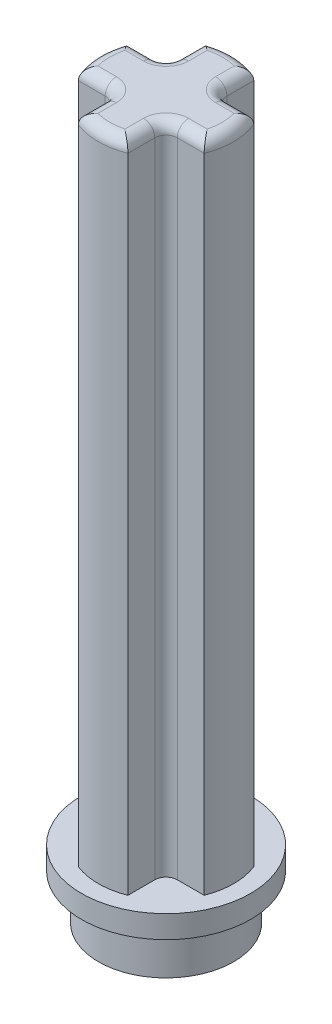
ISO-10303-21;
HEADER;
FILE_DESCRIPTION(('STEP AP214'),'2;1');
FILE_NAME('part.step','',(''),(''),'','','');
FILE_SCHEMA(('AUTOMOTIVE_DESIGN { 1 0 10303 214 1 1 1 1 }'));
ENDSEC;
DATA;
#1=APPLICATION_CONTEXT('core data for automotive mechanical design processes');
#2=APPLICATION_PROTOCOL_DEFINITION('international standard','automotive_design',2000,#1);
#3=PRODUCT_CONTEXT('',#1,'mechanical');
#4=PRODUCT('Part','Part','',(#3));
#5=PRODUCT_RELATED_PRODUCT_CATEGORY('part','',(#4));
#6=PRODUCT_DEFINITION_FORMATION('','',#4);
#7=PRODUCT_DEFINITION_CONTEXT('part definition',#1,'design');
#8=PRODUCT_DEFINITION('design','',#6,#7);
#9=PRODUCT_DEFINITION_SHAPE('','',#8);
#10=(LENGTH_UNIT() NAMED_UNIT(*) SI_UNIT(.MILLI.,.METRE.));
#11=(NAMED_UNIT(*) PLANE_ANGLE_UNIT() SI_UNIT($,.RADIAN.));
#12=(NAMED_UNIT(*) SI_UNIT($,.STERADIAN.) SOLID_ANGLE_UNIT());
#13=UNCERTAINTY_MEASURE_WITH_UNIT(LENGTH_MEASURE(1.E-05),#10,'distance_accuracy_value','');
#14=(GEOMETRIC_REPRESENTATION_CONTEXT(3) GLOBAL_UNCERTAINTY_ASSIGNED_CONTEXT((#13)) GLOBAL_UNIT_ASSIGNED_CONTEXT((#10,
#11,#12)) REPRESENTATION_CONTEXT('',''));
#15=CARTESIAN_POINT('',(0.,0.,0.));
#16=DIRECTION('',(0.,0.,1.));
#17=DIRECTION('',(1.,0.,0.));
#18=AXIS2_PLACEMENT_3D('',#15,#16,#17);
#19=CARTESIAN_POINT('',(-0.88,23.2,-2.23284571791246));
#20=DIRECTION('',(1.,0.,0.));
#21=DIRECTION('',(0.,0.,-1.));
#22=AXIS2_PLACEMENT_3D('',#19,#20,#21);
#23=PLANE('',#22);
#24=DIRECTION('',(0.,-1.,0.));
#25=VECTOR('',#24,1.);
#26=CARTESIAN_POINT('',(-0.88,23.2,-1.28));
#27=LINE('',#26,#25);
#28=CARTESIAN_POINT('',(-0.88,0.,-1.28));
#29=VERTEX_POINT('',#28);
#30=CARTESIAN_POINT('',(-0.88,22.8,-1.28));
#31=VERTEX_POINT('',#30);
#32=EDGE_CURVE('E55',#29,#31,#27,.F.);
#33=ORIENTED_EDGE('',*,*,#32,.T.);
#34=DIRECTION('',(0.,0.,1.));
#35=VECTOR('',#34,1.);
#36=CARTESIAN_POINT('',(-0.88,22.8,-2.23284571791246));
#37=LINE('',#36,#35);
#38=CARTESIAN_POINT('',(-0.88,22.8,-2.23284571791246));
#39=VERTEX_POINT('',#38);
#40=EDGE_CURVE('E208',#31,#39,#37,.F.);
#41=ORIENTED_EDGE('',*,*,#40,.T.);
#42=DIRECTION('',(0.,-1.,0.));
#43=VECTOR('',#42,1.);
#44=CARTESIAN_POINT('',(-0.88,23.2,-2.23284571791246));
#45=LINE('',#44,#43);
#46=CARTESIAN_POINT('',(-0.88,0.,-2.23284571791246));
#47=VERTEX_POINT('',#46);
#48=EDGE_CURVE('E213',#39,#47,#45,.T.);
#49=ORIENTED_EDGE('',*,*,#48,.T.);
#50=DIRECTION('',(0.,0.,1.));
#51=VECTOR('',#50,1.);
#52=CARTESIAN_POINT('',(-0.88,0.,-2.23284571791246));
#53=LINE('',#52,#51);
#54=EDGE_CURVE('E211',#47,#29,#53,.T.);
#55=ORIENTED_EDGE('',*,*,#54,.T.);
#56=EDGE_LOOP('',(#33,#41,#49,#55));
#57=FACE_BOUND('',#56,.T.);
#58=ADVANCED_FACE('F39',(#57),#23,.F.);
#59=CARTESIAN_POINT('',(-2.23284571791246,23.2,-0.88));
#60=DIRECTION('',(0.,0.,1.));
#61=DIRECTION('',(1.,0.,0.));
#62=AXIS2_PLACEMENT_3D('',#59,#60,#61);
#63=PLANE('',#62);
#64=DIRECTION('',(0.,-1.,0.));
#65=VECTOR('',#64,1.);
#66=CARTESIAN_POINT('',(-2.23284571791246,23.2,-0.88));
#67=LINE('',#66,#65);
#68=CARTESIAN_POINT('',(-2.23284571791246,22.8,-0.88));
#69=VERTEX_POINT('',#68);
#70=CARTESIAN_POINT('',(-2.23284571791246,0.,-0.88));
#71=VERTEX_POINT('',#70);
#72=EDGE_CURVE('E554',#69,#71,#67,.T.);
#73=ORIENTED_EDGE('',*,*,#72,.F.);
#74=DIRECTION('',(-1.,0.,0.));
#75=VECTOR('',#74,1.);
#76=CARTESIAN_POINT('',(-0.88,22.8,-0.88));
#77=LINE('',#76,#75);
#78=CARTESIAN_POINT('',(-1.28,22.8,-0.88));
#79=VERTEX_POINT('',#78);
#80=EDGE_CURVE('E63',#69,#79,#77,.F.);
#81=ORIENTED_EDGE('',*,*,#80,.T.);
#82=DIRECTION('',(0.,-1.,0.));
#83=VECTOR('',#82,1.);
#84=CARTESIAN_POINT('',(-1.28,0.,-0.88));
#85=LINE('',#84,#83);
#86=CARTESIAN_POINT('',(-1.28,0.,-0.88));
#87=VERTEX_POINT('',#86);
#88=EDGE_CURVE('E660',#79,#87,#85,.T.);
#89=ORIENTED_EDGE('',*,*,#88,.T.);
#90=DIRECTION('',(-1.,0.,0.));
#91=VECTOR('',#90,1.);
#92=CARTESIAN_POINT('',(-2.23284571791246,0.,-0.88));
#93=LINE('',#92,#91);
#94=EDGE_CURVE('E218',#87,#71,#93,.T.);
#95=ORIENTED_EDGE('',*,*,#94,.T.);
#96=EDGE_LOOP('',(#73,#81,#89,#95));
#97=FACE_BOUND('',#96,.T.);
#98=ADVANCED_FACE('F397',(#97),#63,.F.);
#99=CARTESIAN_POINT('',(0.,23.2,0.));
#100=DIRECTION('',(0.,-1.,0.));
#101=DIRECTION('',(0.,0.,-1.));
#102=AXIS2_PLACEMENT_3D('',#99,#100,#101);
#103=CYLINDRICAL_SURFACE('',#102,2.4);
#104=DIRECTION('',(0.,-1.,0.));
#105=VECTOR('',#104,1.);
#106=CARTESIAN_POINT('',(-2.23284571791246,23.2,0.880000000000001));
#107=LINE('',#106,#105);
#108=CARTESIAN_POINT('',(-2.23284571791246,22.8,0.880000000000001));
#109=VERTEX_POINT('',#108);
#110=CARTESIAN_POINT('',(-2.23284571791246,0.,0.880000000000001));
#111=VERTEX_POINT('',#110);
#112=EDGE_CURVE('E551',#109,#111,#107,.T.);
#113=ORIENTED_EDGE('',*,*,#112,.F.);
#114=CARTESIAN_POINT('',(0.,22.8,0.));
#115=DIRECTION('',(0.,1.,0.));
#116=DIRECTION('',(0.,0.,1.));
#117=AXIS2_PLACEMENT_3D('',#114,#115,#116);
#118=CIRCLE('',#117,2.4);
#119=EDGE_CURVE('E657',#109,#69,#118,.F.);
#120=ORIENTED_EDGE('',*,*,#119,.T.);
#121=ORIENTED_EDGE('',*,*,#72,.T.);
#122=CARTESIAN_POINT('',(0.,0.,0.));
#123=DIRECTION('',(0.,1.,0.));
#124=DIRECTION('',(0.,0.,1.));
#125=AXIS2_PLACEMENT_3D('',#122,#123,#124);
#126=CIRCLE('',#125,2.4);
#127=EDGE_CURVE('E498',#71,#111,#126,.T.);
#128=ORIENTED_EDGE('',*,*,#127,.T.);
#129=EDGE_LOOP('',(#113,#120,#121,#128));
#130=FACE_BOUND('',#129,.T.);
#131=ADVANCED_FACE('F401',(#130),#103,.T.);
#132=CARTESIAN_POINT('',(-0.88,23.2,0.880000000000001));
#133=DIRECTION('',(0.,0.,-1.));
#134=DIRECTION('',(-1.,0.,0.));
#135=AXIS2_PLACEMENT_3D('',#132,#133,#134);
#136=PLANE('',#135);
#137=DIRECTION('',(0.,-1.,0.));
#138=VECTOR('',#137,1.);
#139=CARTESIAN_POINT('',(-1.28,23.2,0.880000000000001));
#140=LINE('',#139,#138);
#141=CARTESIAN_POINT('',(-1.28,0.,0.880000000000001));
#142=VERTEX_POINT('',#141);
#143=CARTESIAN_POINT('',(-1.28,22.8,0.880000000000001));
#144=VERTEX_POINT('',#143);
#145=EDGE_CURVE('E651',#142,#144,#140,.F.);
#146=ORIENTED_EDGE('',*,*,#145,.T.);
#147=DIRECTION('',(1.,0.,0.));
#148=VECTOR('',#147,1.);
#149=CARTESIAN_POINT('',(-2.23284571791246,22.8,0.880000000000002));
#150=LINE('',#149,#148);
#151=EDGE_CURVE('E654',#144,#109,#150,.F.);
#152=ORIENTED_EDGE('',*,*,#151,.T.);
#153=ORIENTED_EDGE('',*,*,#112,.T.);
#154=DIRECTION('',(1.,0.,0.));
#155=VECTOR('',#154,1.);
#156=CARTESIAN_POINT('',(-0.88,0.,0.880000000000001));
#157=LINE('',#156,#155);
#158=EDGE_CURVE('E502',#111,#142,#157,.T.);
#159=ORIENTED_EDGE('',*,*,#158,.T.);
#160=EDGE_LOOP('',(#146,#152,#153,#159));
#161=FACE_BOUND('',#160,.T.);
#162=ADVANCED_FACE('F406',(#161),#136,.F.);
#163=CARTESIAN_POINT('',(-0.88,23.2,0.880000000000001));
#164=DIRECTION('',(1.,0.,0.));
#165=DIRECTION('',(0.,0.,-1.));
#166=AXIS2_PLACEMENT_3D('',#163,#164,#165);
#167=PLANE('',#166);
#168=DIRECTION('',(0.,-1.,0.));
#169=VECTOR('',#168,1.);
#170=CARTESIAN_POINT('',(-0.88,23.2,2.23284571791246));
#171=LINE('',#170,#169);
#172=CARTESIAN_POINT('',(-0.88,22.8,2.23284571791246));
#173=VERTEX_POINT('',#172);
#174=CARTESIAN_POINT('',(-0.88,0.,2.23284571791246));
#175=VERTEX_POINT('',#174);
#176=EDGE_CURVE('E547',#173,#175,#171,.T.);
#177=ORIENTED_EDGE('',*,*,#176,.F.);
#178=DIRECTION('',(0.,0.,1.));
#179=VECTOR('',#178,1.);
#180=CARTESIAN_POINT('',(-0.88,22.8,0.880000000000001));
#181=LINE('',#180,#179);
#182=CARTESIAN_POINT('',(-0.88,22.8,1.28));
#183=VERTEX_POINT('',#182);
#184=EDGE_CURVE('E648',#173,#183,#181,.F.);
#185=ORIENTED_EDGE('',*,*,#184,.T.);
#186=DIRECTION('',(0.,-1.,0.));
#187=VECTOR('',#186,1.);
#188=CARTESIAN_POINT('',(-0.88,0.,1.28));
#189=LINE('',#188,#187);
#190=CARTESIAN_POINT('',(-0.88,0.,1.28));
#191=VERTEX_POINT('',#190);
#192=EDGE_CURVE('E645',#183,#191,#189,.T.);
#193=ORIENTED_EDGE('',*,*,#192,.T.);
#194=DIRECTION('',(0.,0.,1.));
#195=VECTOR('',#194,1.);
#196=CARTESIAN_POINT('',(-0.88,0.,0.880000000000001));
#197=LINE('',#196,#195);
#198=EDGE_CURVE('E505',#191,#175,#197,.T.);
#199=ORIENTED_EDGE('',*,*,#198,.T.);
#200=EDGE_LOOP('',(#177,#185,#193,#199));
#201=FACE_BOUND('',#200,.T.);
#202=ADVANCED_FACE('F410',(#201),#167,.F.);
#203=CARTESIAN_POINT('',(0.,23.2,0.));
#204=DIRECTION('',(0.,-1.,0.));
#205=DIRECTION('',(0.,0.,-1.));
#206=AXIS2_PLACEMENT_3D('',#203,#204,#205);
#207=CYLINDRICAL_SURFACE('',#206,2.4);
#208=DIRECTION('',(0.,-1.,0.));
#209=VECTOR('',#208,1.);
#210=CARTESIAN_POINT('',(0.88,23.2,2.23284571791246));
#211=LINE('',#210,#209);
#212=CARTESIAN_POINT('',(0.88,22.8,2.23284571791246));
#213=VERTEX_POINT('',#212);
#214=CARTESIAN_POINT('',(0.88,0.,2.23284571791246));
#215=VERTEX_POINT('',#214);
#216=EDGE_CURVE('E544',#213,#215,#211,.T.);
#217=ORIENTED_EDGE('',*,*,#216,.F.);
#218=CARTESIAN_POINT('',(0.,22.8,0.));
#219=DIRECTION('',(0.,1.,0.));
#220=DIRECTION('',(0.,0.,1.));
#221=AXIS2_PLACEMENT_3D('',#218,#219,#220);
#222=CIRCLE('',#221,2.4);
#223=EDGE_CURVE('E642',#213,#173,#222,.F.);
#224=ORIENTED_EDGE('',*,*,#223,.T.);
#225=ORIENTED_EDGE('',*,*,#176,.T.);
#226=CARTESIAN_POINT('',(0.,0.,0.));
#227=DIRECTION('',(0.,1.,0.));
#228=DIRECTION('',(0.,0.,1.));
#229=AXIS2_PLACEMENT_3D('',#226,#227,#228);
#230=CIRCLE('',#229,2.4);
#231=EDGE_CURVE('E508',#175,#215,#230,.T.);
#232=ORIENTED_EDGE('',*,*,#231,.T.);
#233=EDGE_LOOP('',(#217,#224,#225,#232));
#234=FACE_BOUND('',#233,.T.);
#235=ADVANCED_FACE('F414',(#234),#207,.T.);
#236=CARTESIAN_POINT('',(0.880000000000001,23.2,2.23284571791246));
#237=DIRECTION('',(-1.,0.,0.));
#238=DIRECTION('',(0.,0.,1.));
#239=AXIS2_PLACEMENT_3D('',#236,#237,#238);
#240=PLANE('',#239);
#241=DIRECTION('',(0.,-1.,0.));
#242=VECTOR('',#241,1.);
#243=CARTESIAN_POINT('',(0.880000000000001,23.2,1.28));
#244=LINE('',#243,#242);
#245=CARTESIAN_POINT('',(0.880000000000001,0.,1.28));
#246=VERTEX_POINT('',#245);
#247=CARTESIAN_POINT('',(0.880000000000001,22.8,1.28));
#248=VERTEX_POINT('',#247);
#249=EDGE_CURVE('E636',#246,#248,#244,.F.);
#250=ORIENTED_EDGE('',*,*,#249,.T.);
#251=DIRECTION('',(0.,0.,-1.));
#252=VECTOR('',#251,1.);
#253=CARTESIAN_POINT('',(0.880000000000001,22.8,2.23284571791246));
#254=LINE('',#253,#252);
#255=EDGE_CURVE('E639',#248,#213,#254,.F.);
#256=ORIENTED_EDGE('',*,*,#255,.T.);
#257=ORIENTED_EDGE('',*,*,#216,.T.);
#258=DIRECTION('',(0.,0.,-1.));
#259=VECTOR('',#258,1.);
#260=CARTESIAN_POINT('',(0.880000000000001,0.,2.23284571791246));
#261=LINE('',#260,#259);
#262=EDGE_CURVE('E512',#215,#246,#261,.T.);
#263=ORIENTED_EDGE('',*,*,#262,.T.);
#264=EDGE_LOOP('',(#250,#256,#257,#263));
#265=FACE_BOUND('',#264,.T.);
#266=ADVANCED_FACE('F418',(#265),#240,.F.);
#267=CARTESIAN_POINT('',(2.23284571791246,23.2,0.880000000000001));
#268=DIRECTION('',(0.,0.,-1.));
#269=DIRECTION('',(-1.,0.,0.));
#270=AXIS2_PLACEMENT_3D('',#267,#268,#269);
#271=PLANE('',#270);
#272=DIRECTION('',(0.,-1.,0.));
#273=VECTOR('',#272,1.);
#274=CARTESIAN_POINT('',(2.23284571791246,23.2,0.880000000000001));
#275=LINE('',#274,#273);
#276=CARTESIAN_POINT('',(2.23284571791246,22.8,0.880000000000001));
#277=VERTEX_POINT('',#276);
#278=CARTESIAN_POINT('',(2.23284571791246,0.,0.880000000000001));
#279=VERTEX_POINT('',#278);
#280=EDGE_CURVE('E540',#277,#279,#275,.T.);
#281=ORIENTED_EDGE('',*,*,#280,.F.);
#282=DIRECTION('',(1.,0.,0.));
#283=VECTOR('',#282,1.);
#284=CARTESIAN_POINT('',(0.880000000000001,22.8,0.880000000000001));
#285=LINE('',#284,#283);
#286=CARTESIAN_POINT('',(1.28,22.8,0.880000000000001));
#287=VERTEX_POINT('',#286);
#288=EDGE_CURVE('E633',#277,#287,#285,.F.);
#289=ORIENTED_EDGE('',*,*,#288,.T.);
#290=DIRECTION('',(0.,-1.,0.));
#291=VECTOR('',#290,1.);
#292=CARTESIAN_POINT('',(1.28,0.,0.880000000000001));
#293=LINE('',#292,#291);
#294=CARTESIAN_POINT('',(1.28,0.,0.880000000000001));
#295=VERTEX_POINT('',#294);
#296=EDGE_CURVE('E630',#287,#295,#293,.T.);
#297=ORIENTED_EDGE('',*,*,#296,.T.);
#298=DIRECTION('',(1.,0.,0.));
#299=VECTOR('',#298,1.);
#300=CARTESIAN_POINT('',(2.23284571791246,0.,0.880000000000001));
#301=LINE('',#300,#299);
#302=EDGE_CURVE('E515',#295,#279,#301,.T.);
#303=ORIENTED_EDGE('',*,*,#302,.T.);
#304=EDGE_LOOP('',(#281,#289,#297,#303));
#305=FACE_BOUND('',#304,.T.);
#306=ADVANCED_FACE('F422',(#305),#271,.F.);
#307=CARTESIAN_POINT('',(0.,23.2,0.));
#308=DIRECTION('',(0.,-1.,0.));
#309=DIRECTION('',(0.,0.,-1.));
#310=AXIS2_PLACEMENT_3D('',#307,#308,#309);
#311=CYLINDRICAL_SURFACE('',#310,2.4);
#312=DIRECTION('',(0.,-1.,0.));
#313=VECTOR('',#312,1.);
#314=CARTESIAN_POINT('',(2.23284571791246,23.2,-0.88));
#315=LINE('',#314,#313);
#316=CARTESIAN_POINT('',(2.23284571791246,22.8,-0.88));
#317=VERTEX_POINT('',#316);
#318=CARTESIAN_POINT('',(2.23284571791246,0.,-0.88));
#319=VERTEX_POINT('',#318);
#320=EDGE_CURVE('E537',#317,#319,#315,.T.);
#321=ORIENTED_EDGE('',*,*,#320,.F.);
#322=CARTESIAN_POINT('',(0.,22.8,0.));
#323=DIRECTION('',(0.,1.,0.));
#324=DIRECTION('',(0.,0.,1.));
#325=AXIS2_PLACEMENT_3D('',#322,#323,#324);
#326=CIRCLE('',#325,2.4);
#327=EDGE_CURVE('E627',#317,#277,#326,.F.);
#328=ORIENTED_EDGE('',*,*,#327,.T.);
#329=ORIENTED_EDGE('',*,*,#280,.T.);
#330=CARTESIAN_POINT('',(0.,0.,0.));
#331=DIRECTION('',(0.,1.,0.));
#332=DIRECTION('',(0.,0.,1.));
#333=AXIS2_PLACEMENT_3D('',#330,#331,#332);
#334=CIRCLE('',#333,2.4);
#335=EDGE_CURVE('E518',#279,#319,#334,.T.);
#336=ORIENTED_EDGE('',*,*,#335,.T.);
#337=EDGE_LOOP('',(#321,#328,#329,#336));
#338=FACE_BOUND('',#337,.T.);
#339=ADVANCED_FACE('F426',(#338),#311,.T.);
#340=CARTESIAN_POINT('',(0.880000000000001,23.2,-0.88));
#341=DIRECTION('',(0.,0.,1.));
#342=DIRECTION('',(1.,0.,0.));
#343=AXIS2_PLACEMENT_3D('',#340,#341,#342);
#344=PLANE('',#343);
#345=DIRECTION('',(0.,-1.,0.));
#346=VECTOR('',#345,1.);
#347=CARTESIAN_POINT('',(1.28,23.2,-0.88));
#348=LINE('',#347,#346);
#349=CARTESIAN_POINT('',(1.28,0.,-0.88));
#350=VERTEX_POINT('',#349);
#351=CARTESIAN_POINT('',(1.28,22.8,-0.88));
#352=VERTEX_POINT('',#351);
#353=EDGE_CURVE('E621',#350,#352,#348,.F.);
#354=ORIENTED_EDGE('',*,*,#353,.T.);
#355=DIRECTION('',(-1.,0.,0.));
#356=VECTOR('',#355,1.);
#357=CARTESIAN_POINT('',(2.23284571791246,22.8,-0.88));
#358=LINE('',#357,#356);
#359=EDGE_CURVE('E624',#352,#317,#358,.F.);
#360=ORIENTED_EDGE('',*,*,#359,.T.);
#361=ORIENTED_EDGE('',*,*,#320,.T.);
#362=DIRECTION('',(-1.,0.,0.));
#363=VECTOR('',#362,1.);
#364=CARTESIAN_POINT('',(0.880000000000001,0.,-0.88));
#365=LINE('',#364,#363);
#366=EDGE_CURVE('E522',#319,#350,#365,.T.);
#367=ORIENTED_EDGE('',*,*,#366,.T.);
#368=EDGE_LOOP('',(#354,#360,#361,#367));
#369=FACE_BOUND('',#368,.T.);
#370=ADVANCED_FACE('F430',(#369),#344,.F.);
#371=CARTESIAN_POINT('',(0.880000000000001,23.2,-0.88));
#372=DIRECTION('',(-1.,0.,0.));
#373=DIRECTION('',(0.,0.,1.));
#374=AXIS2_PLACEMENT_3D('',#371,#372,#373);
#375=PLANE('',#374);
#376=DIRECTION('',(0.,-1.,0.));
#377=VECTOR('',#376,1.);
#378=CARTESIAN_POINT('',(0.880000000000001,23.2,-2.23284571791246));
#379=LINE('',#378,#377);
#380=CARTESIAN_POINT('',(0.880000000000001,22.8,-2.23284571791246));
#381=VERTEX_POINT('',#380);
#382=CARTESIAN_POINT('',(0.880000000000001,0.,-2.23284571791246));
#383=VERTEX_POINT('',#382);
#384=EDGE_CURVE('E533',#381,#383,#379,.T.);
#385=ORIENTED_EDGE('',*,*,#384,.F.);
#386=DIRECTION('',(0.,0.,-1.));
#387=VECTOR('',#386,1.);
#388=CARTESIAN_POINT('',(0.880000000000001,22.8,-0.88));
#389=LINE('',#388,#387);
#390=CARTESIAN_POINT('',(0.880000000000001,22.8,-1.28));
#391=VERTEX_POINT('',#390);
#392=EDGE_CURVE('E618',#381,#391,#389,.F.);
#393=ORIENTED_EDGE('',*,*,#392,.T.);
#394=DIRECTION('',(0.,-1.,0.));
#395=VECTOR('',#394,1.);
#396=CARTESIAN_POINT('',(0.880000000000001,0.,-1.28));
#397=LINE('',#396,#395);
#398=CARTESIAN_POINT('',(0.880000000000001,0.,-1.28));
#399=VERTEX_POINT('',#398);
#400=EDGE_CURVE('E615',#391,#399,#397,.T.);
#401=ORIENTED_EDGE('',*,*,#400,.T.);
#402=DIRECTION('',(0.,0.,-1.));
#403=VECTOR('',#402,1.);
#404=CARTESIAN_POINT('',(0.880000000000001,0.,-0.88));
#405=LINE('',#404,#403);
#406=EDGE_CURVE('E525',#399,#383,#405,.T.);
#407=ORIENTED_EDGE('',*,*,#406,.T.);
#408=EDGE_LOOP('',(#385,#393,#401,#407));
#409=FACE_BOUND('',#408,.T.);
#410=ADVANCED_FACE('F434',(#409),#375,.F.);
#411=CARTESIAN_POINT('',(0.,23.2,0.));
#412=DIRECTION('',(0.,-1.,0.));
#413=DIRECTION('',(0.,0.,-1.));
#414=AXIS2_PLACEMENT_3D('',#411,#412,#413);
#415=CYLINDRICAL_SURFACE('',#414,2.4);
#416=ORIENTED_EDGE('',*,*,#48,.F.);
#417=CARTESIAN_POINT('',(0.,22.8,0.));
#418=DIRECTION('',(0.,1.,0.));
#419=DIRECTION('',(0.,0.,1.));
#420=AXIS2_PLACEMENT_3D('',#417,#418,#419);
#421=CIRCLE('',#420,2.4);
#422=EDGE_CURVE('E611',#39,#381,#421,.F.);
#423=ORIENTED_EDGE('',*,*,#422,.T.);
#424=ORIENTED_EDGE('',*,*,#384,.T.);
#425=CARTESIAN_POINT('',(0.,0.,0.));
#426=DIRECTION('',(0.,1.,0.));
#427=DIRECTION('',(0.,0.,1.));
#428=AXIS2_PLACEMENT_3D('',#425,#426,#427);
#429=CIRCLE('',#428,2.4);
#430=EDGE_CURVE('E528',#383,#47,#429,.T.);
#431=ORIENTED_EDGE('',*,*,#430,.T.);
#432=EDGE_LOOP('',(#416,#423,#424,#431));
#433=FACE_BOUND('',#432,.T.);
#434=ADVANCED_FACE('F438',(#433),#415,.T.);
#435=CARTESIAN_POINT('',(0.,23.2,0.));
#436=DIRECTION('',(0.,1.,0.));
#437=DIRECTION('',(0.,0.,1.));
#438=AXIS2_PLACEMENT_3D('',#435,#436,#437);
#439=PLANE('',#438);
#440=CARTESIAN_POINT('',(0.,23.2,0.));
#441=DIRECTION('',(0.,1.,0.));
#442=DIRECTION('',(0.,0.,1.));
#443=AXIS2_PLACEMENT_3D('',#440,#441,#442);
#444=CIRCLE('',#443,2.);
#445=CARTESIAN_POINT('',(1.94154577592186,23.2,0.480000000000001));
#446=VERTEX_POINT('',#445);
#447=CARTESIAN_POINT('',(1.94154577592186,23.2,-0.48));
#448=VERTEX_POINT('',#447);
#449=EDGE_CURVE('E601',#446,#448,#444,.T.);
#450=ORIENTED_EDGE('',*,*,#449,.T.);
#451=DIRECTION('',(-1.,0.,0.));
#452=VECTOR('',#451,1.);
#453=CARTESIAN_POINT('',(0.880000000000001,23.2,-0.48));
#454=LINE('',#453,#452);
#455=CARTESIAN_POINT('',(1.28,23.2,-0.48));
#456=VERTEX_POINT('',#455);
#457=EDGE_CURVE('E608',#448,#456,#454,.T.);
#458=ORIENTED_EDGE('',*,*,#457,.T.);
#459=CARTESIAN_POINT('',(1.28,23.2,-1.28));
#460=DIRECTION('',(0.,1.,0.));
#461=DIRECTION('',(0.,0.,1.));
#462=AXIS2_PLACEMENT_3D('',#459,#460,#461);
#463=CIRCLE('',#462,0.8);
#464=CARTESIAN_POINT('',(0.480000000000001,23.2,-1.28));
#465=VERTEX_POINT('',#464);
#466=EDGE_CURVE('E604',#465,#456,#463,.T.);
#467=ORIENTED_EDGE('',*,*,#466,.F.);
#468=DIRECTION('',(0.,0.,-1.));
#469=VECTOR('',#468,1.);
#470=CARTESIAN_POINT('',(0.480000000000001,23.2,-2.23284571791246));
#471=LINE('',#470,#469);
#472=CARTESIAN_POINT('',(0.480000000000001,23.2,-1.94154577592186));
#473=VERTEX_POINT('',#472);
#474=EDGE_CURVE('E591',#465,#473,#471,.T.);
#475=ORIENTED_EDGE('',*,*,#474,.T.);
#476=CARTESIAN_POINT('',(0.,23.2,0.));
#477=DIRECTION('',(0.,1.,0.));
#478=DIRECTION('',(0.,0.,1.));
#479=AXIS2_PLACEMENT_3D('',#476,#477,#478);
#480=CIRCLE('',#479,2.);
#481=CARTESIAN_POINT('',(-0.48,23.2,-1.94154577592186));
#482=VERTEX_POINT('',#481);
#483=EDGE_CURVE('E574',#473,#482,#480,.T.);
#484=ORIENTED_EDGE('',*,*,#483,.T.);
#485=DIRECTION('',(0.,0.,1.));
#486=VECTOR('',#485,1.);
#487=CARTESIAN_POINT('',(-0.48,23.2,-0.88));
#488=LINE('',#487,#486);
#489=CARTESIAN_POINT('',(-0.48,23.2,-1.28));
#490=VERTEX_POINT('',#489);
#491=EDGE_CURVE('E562',#482,#490,#488,.T.);
#492=ORIENTED_EDGE('',*,*,#491,.T.);
#493=CARTESIAN_POINT('',(-1.28,23.2,-1.28));
#494=DIRECTION('',(0.,1.,0.));
#495=DIRECTION('',(0.,0.,1.));
#496=AXIS2_PLACEMENT_3D('',#493,#494,#495);
#497=CIRCLE('',#496,0.8);
#498=CARTESIAN_POINT('',(-1.28,23.2,-0.48));
#499=VERTEX_POINT('',#498);
#500=EDGE_CURVE('E558',#499,#490,#497,.T.);
#501=ORIENTED_EDGE('',*,*,#500,.F.);
#502=DIRECTION('',(-1.,0.,0.));
#503=VECTOR('',#502,1.);
#504=CARTESIAN_POINT('',(-2.23284571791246,23.2,-0.48));
#505=LINE('',#504,#503);
#506=CARTESIAN_POINT('',(-1.94154577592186,23.2,-0.48));
#507=VERTEX_POINT('',#506);
#508=EDGE_CURVE('E565',#499,#507,#505,.T.);
#509=ORIENTED_EDGE('',*,*,#508,.T.);
#510=CARTESIAN_POINT('',(0.,23.2,0.));
#511=DIRECTION('',(0.,1.,0.));
#512=DIRECTION('',(0.,0.,1.));
#513=AXIS2_PLACEMENT_3D('',#510,#511,#512);
#514=CIRCLE('',#513,2.);
#515=CARTESIAN_POINT('',(-1.94154577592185,23.2,0.480000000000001));
#516=VERTEX_POINT('',#515);
#517=EDGE_CURVE('E568',#507,#516,#514,.T.);
#518=ORIENTED_EDGE('',*,*,#517,.T.);
#519=DIRECTION('',(1.,0.,0.));
#520=VECTOR('',#519,1.);
#521=CARTESIAN_POINT('',(-0.88,23.2,0.480000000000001));
#522=LINE('',#521,#520);
#523=CARTESIAN_POINT('',(-1.28,23.2,0.480000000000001));
#524=VERTEX_POINT('',#523);
#525=EDGE_CURVE('E571',#516,#524,#522,.T.);
#526=ORIENTED_EDGE('',*,*,#525,.T.);
#527=CARTESIAN_POINT('',(-1.28,23.2,1.28));
#528=DIRECTION('',(0.,1.,0.));
#529=DIRECTION('',(0.,0.,1.));
#530=AXIS2_PLACEMENT_3D('',#527,#528,#529);
#531=CIRCLE('',#530,0.8);
#532=CARTESIAN_POINT('',(-0.48,23.2,1.28));
#533=VERTEX_POINT('',#532);
#534=EDGE_CURVE('E578',#533,#524,#531,.T.);
#535=ORIENTED_EDGE('',*,*,#534,.F.);
#536=DIRECTION('',(0.,0.,1.));
#537=VECTOR('',#536,1.);
#538=CARTESIAN_POINT('',(-0.48,23.2,2.23284571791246));
#539=LINE('',#538,#537);
#540=CARTESIAN_POINT('',(-0.48,23.2,1.94154577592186));
#541=VERTEX_POINT('',#540);
#542=EDGE_CURVE('E582',#533,#541,#539,.T.);
#543=ORIENTED_EDGE('',*,*,#542,.T.);
#544=CARTESIAN_POINT('',(0.,23.2,0.));
#545=DIRECTION('',(0.,1.,0.));
#546=DIRECTION('',(0.,0.,1.));
#547=AXIS2_PLACEMENT_3D('',#544,#545,#546);
#548=CIRCLE('',#547,2.);
#549=CARTESIAN_POINT('',(0.48,23.2,1.94154577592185));
#550=VERTEX_POINT('',#549);
#551=EDGE_CURVE('E585',#541,#550,#548,.T.);
#552=ORIENTED_EDGE('',*,*,#551,.T.);
#553=DIRECTION('',(0.,0.,-1.));
#554=VECTOR('',#553,1.);
#555=CARTESIAN_POINT('',(0.480000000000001,23.2,0.880000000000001));
#556=LINE('',#555,#554);
#557=CARTESIAN_POINT('',(0.480000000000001,23.2,1.28));
#558=VERTEX_POINT('',#557);
#559=EDGE_CURVE('E588',#550,#558,#556,.T.);
#560=ORIENTED_EDGE('',*,*,#559,.T.);
#561=CARTESIAN_POINT('',(1.28,23.2,1.28));
#562=DIRECTION('',(0.,1.,0.));
#563=DIRECTION('',(0.,0.,1.));
#564=AXIS2_PLACEMENT_3D('',#561,#562,#563);
#565=CIRCLE('',#564,0.8);
#566=CARTESIAN_POINT('',(1.28,23.2,0.480000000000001));
#567=VERTEX_POINT('',#566);
#568=EDGE_CURVE('E594',#567,#558,#565,.T.);
#569=ORIENTED_EDGE('',*,*,#568,.F.);
#570=DIRECTION('',(1.,0.,0.));
#571=VECTOR('',#570,1.);
#572=CARTESIAN_POINT('',(2.23284571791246,23.2,0.480000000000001));
#573=LINE('',#572,#571);
#574=EDGE_CURVE('E598',#567,#446,#573,.T.);
#575=ORIENTED_EDGE('',*,*,#574,.T.);
#576=EDGE_LOOP('',(#450,#458,#467,#475,#484,#492,#501,#509,#518,#526,#535,#543,#552,#560,#569,#575));
#577=FACE_BOUND('',#576,.T.);
#578=ADVANCED_FACE('F381',(#577),#439,.T.);
#579=CARTESIAN_POINT('',(0.,22.8,0.));
#580=DIRECTION('',(0.,1.,0.));
#581=DIRECTION('',(0.,0.,1.));
#582=AXIS2_PLACEMENT_3D('',#579,#580,#581);
#583=TOROIDAL_SURFACE('',#582,2.,0.4);
#584=CARTESIAN_POINT('',(-0.88,22.8,2.23284571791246));
#585=CARTESIAN_POINT('',(-0.880027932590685,22.8196677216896,2.23286229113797));
#586=CARTESIAN_POINT('',(-0.878551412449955,22.8393093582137,2.23185960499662));
#587=CARTESIAN_POINT('',(-0.872817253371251,22.8778900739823,2.22795221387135));
#588=CARTESIAN_POINT('',(-0.868573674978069,22.8968321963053,2.22505712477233));
#589=CARTESIAN_POINT('',(-0.857535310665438,22.9335523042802,2.21750324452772));
#590=CARTESIAN_POINT('',(-0.850743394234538,22.9513315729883,2.21284643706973));
#591=CARTESIAN_POINT('',(-0.83494883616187,22.9853742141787,2.20197052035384));
#592=CARTESIAN_POINT('',(-0.825943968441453,23.0016360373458,2.19574983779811));
#593=CARTESIAN_POINT('',(-0.805515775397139,23.0332696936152,2.18156387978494));
#594=CARTESIAN_POINT('',(-0.793981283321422,23.0485327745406,2.1735174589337));
#595=CARTESIAN_POINT('',(-0.769295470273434,23.0768786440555,2.15618491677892));
#596=CARTESIAN_POINT('',(-0.756143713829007,23.0899608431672,2.14689846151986));
#597=CARTESIAN_POINT('',(-0.726380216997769,23.1158258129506,2.12572929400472));
#598=CARTESIAN_POINT('',(-0.709553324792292,23.1282155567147,2.11366981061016));
#599=CARTESIAN_POINT('',(-0.674765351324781,23.1499832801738,2.08850314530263));
#600=CARTESIAN_POINT('',(-0.656803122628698,23.1593581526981,2.07539489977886));
#601=CARTESIAN_POINT('',(-0.616725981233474,23.1766538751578,2.04585046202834));
#602=CARTESIAN_POINT('',(-0.594467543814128,23.1839655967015,2.02925334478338));
#603=CARTESIAN_POINT('',(-0.549587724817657,23.1945738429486,1.99535297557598));
#604=CARTESIAN_POINT('',(-0.526966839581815,23.1978754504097,1.97805064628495));
#605=CARTESIAN_POINT('',(-0.497330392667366,23.1996873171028,1.95507409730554));
#606=CARTESIAN_POINT('',(-0.490258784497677,23.1999307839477,1.94956846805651));
#607=CARTESIAN_POINT('',(-0.482131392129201,23.1999957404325,1.94321386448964));
#608=CARTESIAN_POINT('',(-0.481065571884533,23.1999999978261,1.94237999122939));
#609=CARTESIAN_POINT('',(-0.48,23.2,1.94154577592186));
#610=B_SPLINE_CURVE_WITH_KNOTS('',3,(#584,#585,#586,#587,#588,#589,#590,#591,#592,#593,#594,
#595,#596,#597,#598,#599,#600,#601,#602,#603,#604,#605,#606,#607,#608,#609),.UNSPECIFIED.,.F.,
.F.,(4,2,2,2,2,2,2,2,2,2,2,2,4),(0.,0.0588812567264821,0.117465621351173,0.175984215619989,
0.234561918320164,0.296588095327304,0.358631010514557,0.430741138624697,0.502925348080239,
0.588744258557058,0.674454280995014,0.70134553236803,0.705405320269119),.UNSPECIFIED.);
#611=EDGE_CURVE('E362',#173,#541,#610,.T.);
#612=ORIENTED_EDGE('',*,*,#611,.F.);
#613=ORIENTED_EDGE('',*,*,#223,.F.);
#614=CARTESIAN_POINT('',(0.88,22.8,2.23284571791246));
#615=CARTESIAN_POINT('',(0.880027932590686,22.8196677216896,2.23286229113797));
#616=CARTESIAN_POINT('',(0.878551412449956,22.8393093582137,2.23185960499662));
#617=CARTESIAN_POINT('',(0.872817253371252,22.8778900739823,2.22795221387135));
#618=CARTESIAN_POINT('',(0.868573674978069,22.8968321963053,2.22505712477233));
#619=CARTESIAN_POINT('',(0.857535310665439,22.9335523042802,2.21750324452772));
#620=CARTESIAN_POINT('',(0.850743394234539,22.9513315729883,2.21284643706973));
#621=CARTESIAN_POINT('',(0.834948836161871,22.9853742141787,2.20197052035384));
#622=CARTESIAN_POINT('',(0.825943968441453,23.0016360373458,2.19574983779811));
#623=CARTESIAN_POINT('',(0.80551577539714,23.0332696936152,2.18156387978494));
#624=CARTESIAN_POINT('',(0.793981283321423,23.0485327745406,2.1735174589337));
#625=CARTESIAN_POINT('',(0.769295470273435,23.0768786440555,2.15618491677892));
#626=CARTESIAN_POINT('',(0.756143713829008,23.0899608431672,2.14689846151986));
#627=CARTESIAN_POINT('',(0.72638021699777,23.1158258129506,2.12572929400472));
#628=CARTESIAN_POINT('',(0.709553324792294,23.1282155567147,2.11366981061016));
#629=CARTESIAN_POINT('',(0.674765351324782,23.1499832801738,2.08850314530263));
#630=CARTESIAN_POINT('',(0.656803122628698,23.1593581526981,2.07539489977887));
#631=CARTESIAN_POINT('',(0.616725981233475,23.1766538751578,2.04585046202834));
#632=CARTESIAN_POINT('',(0.594467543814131,23.1839655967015,2.02925334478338));
#633=CARTESIAN_POINT('',(0.549587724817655,23.1945738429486,1.99535297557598));
#634=CARTESIAN_POINT('',(0.526966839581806,23.1978754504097,1.97805064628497));
#635=CARTESIAN_POINT('',(0.49733039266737,23.1996873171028,1.95507409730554));
#636=CARTESIAN_POINT('',(0.490258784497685,23.1999307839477,1.9495684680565));
#637=CARTESIAN_POINT('',(0.482131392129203,23.1999957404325,1.94321386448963));
#638=CARTESIAN_POINT('',(0.481065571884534,23.1999999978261,1.94237999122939));
#639=CARTESIAN_POINT('',(0.480000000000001,23.2,1.94154577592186));
#640=B_SPLINE_CURVE_WITH_KNOTS('',3,(#614,#615,#616,#617,#618,#619,#620,#621,#622,#623,#624,
#625,#626,#627,#628,#629,#630,#631,#632,#633,#634,#635,#636,#637,#638,#639),.UNSPECIFIED.,.F.,
.F.,(4,2,2,2,2,2,2,2,2,2,2,2,4),(0.,0.058881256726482,0.117465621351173,0.175984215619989,
0.234561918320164,0.296588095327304,0.358631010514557,0.430741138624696,0.502925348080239,
0.588744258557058,0.674454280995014,0.701345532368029,0.705405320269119),.UNSPECIFIED.);
#641=EDGE_CURVE('E219',#550,#213,#640,.F.);
#642=ORIENTED_EDGE('',*,*,#641,.F.);
#643=ORIENTED_EDGE('',*,*,#551,.F.);
#644=EDGE_LOOP('',(#612,#613,#642,#643));
#645=FACE_BOUND('',#644,.T.);
#646=ADVANCED_FACE('F378',(#645),#583,.T.);
#647=CARTESIAN_POINT('',(1.28,23.2,1.28));
#648=DIRECTION('',(0.,1.,0.));
#649=DIRECTION('',(0.,0.,1.));
#650=AXIS2_PLACEMENT_3D('',#647,#648,#649);
#651=CYLINDRICAL_SURFACE('',#650,0.4);
#652=CARTESIAN_POINT('',(1.28,0.,1.28));
#653=DIRECTION('',(0.,1.,0.));
#654=DIRECTION('',(0.,0.,1.));
#655=AXIS2_PLACEMENT_3D('',#652,#653,#654);
#656=CIRCLE('',#655,0.4);
#657=EDGE_CURVE('E229',#295,#246,#656,.T.);
#658=ORIENTED_EDGE('',*,*,#657,.F.);
#659=ORIENTED_EDGE('',*,*,#296,.F.);
#660=CARTESIAN_POINT('',(1.28,22.8,1.28));
#661=DIRECTION('',(0.,1.,0.));
#662=DIRECTION('',(0.,0.,1.));
#663=AXIS2_PLACEMENT_3D('',#660,#661,#662);
#664=CIRCLE('',#663,0.4);
#665=EDGE_CURVE('E358',#248,#287,#664,.F.);
#666=ORIENTED_EDGE('',*,*,#665,.F.);
#667=ORIENTED_EDGE('',*,*,#249,.F.);
#668=EDGE_LOOP('',(#658,#659,#666,#667));
#669=FACE_BOUND('',#668,.T.);
#670=ADVANCED_FACE('F41',(#669),#651,.F.);
#671=CARTESIAN_POINT('',(0.480000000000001,22.8,0.));
#672=DIRECTION('',(0.,0.,1.));
#673=DIRECTION('',(1.,0.,0.));
#674=AXIS2_PLACEMENT_3D('',#671,#672,#673);
#675=CYLINDRICAL_SURFACE('',#674,0.4);
#676=ORIENTED_EDGE('',*,*,#641,.T.);
#677=ORIENTED_EDGE('',*,*,#255,.F.);
#678=CARTESIAN_POINT('',(0.480000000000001,22.8,1.28));
#679=DIRECTION('',(0.,0.,-1.));
#680=DIRECTION('',(-1.,0.,0.));
#681=AXIS2_PLACEMENT_3D('',#678,#679,#680);
#682=CIRCLE('',#681,0.4);
#683=EDGE_CURVE('E354',#558,#248,#682,.T.);
#684=ORIENTED_EDGE('',*,*,#683,.F.);
#685=ORIENTED_EDGE('',*,*,#559,.F.);
#686=EDGE_LOOP('',(#676,#677,#684,#685));
#687=FACE_BOUND('',#686,.T.);
#688=ADVANCED_FACE('F383',(#687),#675,.T.);
#689=CARTESIAN_POINT('',(-0.48,22.8,0.));
#690=DIRECTION('',(0.,0.,-1.));
#691=DIRECTION('',(-1.,0.,0.));
#692=AXIS2_PLACEMENT_3D('',#689,#690,#691);
#693=CYLINDRICAL_SURFACE('',#692,0.4);
#694=ORIENTED_EDGE('',*,*,#611,.T.);
#695=ORIENTED_EDGE('',*,*,#542,.F.);
#696=CARTESIAN_POINT('',(-0.48,22.8,1.28));
#697=DIRECTION('',(0.,0.,-1.));
#698=DIRECTION('',(-1.,0.,0.));
#699=AXIS2_PLACEMENT_3D('',#696,#697,#698);
#700=CIRCLE('',#699,0.4);
#701=EDGE_CURVE('E350',#183,#533,#700,.T.);
#702=ORIENTED_EDGE('',*,*,#701,.F.);
#703=ORIENTED_EDGE('',*,*,#184,.F.);
#704=EDGE_LOOP('',(#694,#695,#702,#703));
#705=FACE_BOUND('',#704,.T.);
#706=ADVANCED_FACE('F375',(#705),#693,.T.);
#707=CARTESIAN_POINT('',(-1.28,23.2,1.28));
#708=DIRECTION('',(0.,1.,0.));
#709=DIRECTION('',(0.,0.,1.));
#710=AXIS2_PLACEMENT_3D('',#707,#708,#709);
#711=CYLINDRICAL_SURFACE('',#710,0.4);
#712=CARTESIAN_POINT('',(-1.28,0.,1.28));
#713=DIRECTION('',(0.,1.,0.));
#714=DIRECTION('',(0.,0.,1.));
#715=AXIS2_PLACEMENT_3D('',#712,#713,#714);
#716=CIRCLE('',#715,0.4);
#717=EDGE_CURVE('E667',#191,#142,#716,.T.);
#718=ORIENTED_EDGE('',*,*,#717,.F.);
#719=ORIENTED_EDGE('',*,*,#192,.F.);
#720=CARTESIAN_POINT('',(-1.28,22.8,1.28));
#721=DIRECTION('',(0.,1.,0.));
#722=DIRECTION('',(0.,0.,1.));
#723=AXIS2_PLACEMENT_3D('',#720,#721,#722);
#724=CIRCLE('',#723,0.4);
#725=EDGE_CURVE('E346',#144,#183,#724,.F.);
#726=ORIENTED_EDGE('',*,*,#725,.F.);
#727=ORIENTED_EDGE('',*,*,#145,.F.);
#728=EDGE_LOOP('',(#718,#719,#726,#727));
#729=FACE_BOUND('',#728,.T.);
#730=ADVANCED_FACE('F392',(#729),#711,.F.);
#731=CARTESIAN_POINT('',(1.28,22.8,1.28));
#732=DIRECTION('',(0.,1.,0.));
#733=DIRECTION('',(0.,0.,1.));
#734=AXIS2_PLACEMENT_3D('',#731,#732,#733);
#735=TOROIDAL_SURFACE('',#734,0.8,0.4);
#736=ORIENTED_EDGE('',*,*,#683,.T.);
#737=ORIENTED_EDGE('',*,*,#665,.T.);
#738=CARTESIAN_POINT('',(1.28,22.8,0.480000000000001));
#739=DIRECTION('',(-1.,0.,0.));
#740=DIRECTION('',(0.,0.,1.));
#741=AXIS2_PLACEMENT_3D('',#738,#739,#740);
#742=CIRCLE('',#741,0.4);
#743=EDGE_CURVE('E342',#567,#287,#742,.F.);
#744=ORIENTED_EDGE('',*,*,#743,.F.);
#745=ORIENTED_EDGE('',*,*,#568,.T.);
#746=EDGE_LOOP('',(#736,#737,#744,#745));
#747=FACE_BOUND('',#746,.T.);
#748=ADVANCED_FACE('F738',(#747),#735,.T.);
#749=CARTESIAN_POINT('',(-1.28,22.8,1.28));
#750=DIRECTION('',(0.,1.,0.));
#751=DIRECTION('',(0.,0.,1.));
#752=AXIS2_PLACEMENT_3D('',#749,#750,#751);
#753=TOROIDAL_SURFACE('',#752,0.8,0.4);
#754=ORIENTED_EDGE('',*,*,#701,.T.);
#755=ORIENTED_EDGE('',*,*,#534,.T.);
#756=CARTESIAN_POINT('',(-1.28,22.8,0.480000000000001));
#757=DIRECTION('',(1.,0.,0.));
#758=DIRECTION('',(0.,0.,-1.));
#759=AXIS2_PLACEMENT_3D('',#756,#757,#758);
#760=CIRCLE('',#759,0.4);
#761=EDGE_CURVE('E338',#144,#524,#760,.F.);
#762=ORIENTED_EDGE('',*,*,#761,.F.);
#763=ORIENTED_EDGE('',*,*,#725,.T.);
#764=EDGE_LOOP('',(#754,#755,#762,#763));
#765=FACE_BOUND('',#764,.T.);
#766=ADVANCED_FACE('F327',(#765),#753,.T.);
#767=CARTESIAN_POINT('',(0.,22.8,0.480000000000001));
#768=DIRECTION('',(-1.,0.,0.));
#769=DIRECTION('',(0.,0.,1.));
#770=AXIS2_PLACEMENT_3D('',#767,#768,#769);
#771=CYLINDRICAL_SURFACE('',#770,0.4);
#772=ORIENTED_EDGE('',*,*,#743,.T.);
#773=ORIENTED_EDGE('',*,*,#288,.F.);
#774=CARTESIAN_POINT('',(2.23284571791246,22.8,0.880000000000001));
#775=CARTESIAN_POINT('',(2.23286229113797,22.8196677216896,0.880027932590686));
#776=CARTESIAN_POINT('',(2.23185960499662,22.8393093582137,0.878551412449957));
#777=CARTESIAN_POINT('',(2.22795221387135,22.8778900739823,0.872817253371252));
#778=CARTESIAN_POINT('',(2.22505712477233,22.8968321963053,0.86857367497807));
#779=CARTESIAN_POINT('',(2.21750324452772,22.9335523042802,0.85753531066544));
#780=CARTESIAN_POINT('',(2.21284643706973,22.9513315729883,0.850743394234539));
#781=CARTESIAN_POINT('',(2.20197052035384,22.9853742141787,0.834948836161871));
#782=CARTESIAN_POINT('',(2.19574983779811,23.0016360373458,0.825943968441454));
#783=CARTESIAN_POINT('',(2.18156387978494,23.0332696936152,0.805515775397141));
#784=CARTESIAN_POINT('',(2.1735174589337,23.0485327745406,0.793981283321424));
#785=CARTESIAN_POINT('',(2.15618491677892,23.0768786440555,0.769295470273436));
#786=CARTESIAN_POINT('',(2.14689846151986,23.0899608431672,0.756143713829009));
#787=CARTESIAN_POINT('',(2.12572929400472,23.1158258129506,0.72638021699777));
#788=CARTESIAN_POINT('',(2.11366981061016,23.1282155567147,0.709553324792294));
#789=CARTESIAN_POINT('',(2.08850314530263,23.1499832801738,0.674765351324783));
#790=CARTESIAN_POINT('',(2.07539489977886,23.1593581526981,0.656803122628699));
#791=CARTESIAN_POINT('',(2.04585046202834,23.1766538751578,0.616725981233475));
#792=CARTESIAN_POINT('',(2.02925334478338,23.1839655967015,0.594467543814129));
#793=CARTESIAN_POINT('',(1.99535297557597,23.1945738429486,0.549587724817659));
#794=CARTESIAN_POINT('',(1.97805064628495,23.1978754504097,0.526966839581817));
#795=CARTESIAN_POINT('',(1.95507409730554,23.1996873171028,0.497330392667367));
#796=CARTESIAN_POINT('',(1.94956846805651,23.1999307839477,0.490258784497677));
#797=CARTESIAN_POINT('',(1.94321386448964,23.1999957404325,0.482131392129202));
#798=CARTESIAN_POINT('',(1.94237999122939,23.1999999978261,0.481065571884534));
#799=CARTESIAN_POINT('',(1.94154577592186,23.2,0.480000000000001));
#800=B_SPLINE_CURVE_WITH_KNOTS('',3,(#774,#775,#776,#777,#778,#779,#780,#781,#782,#783,#784,
#785,#786,#787,#788,#789,#790,#791,#792,#793,#794,#795,#796,#797,#798,#799),.UNSPECIFIED.,.F.,
.F.,(4,2,2,2,2,2,2,2,2,2,2,2,4),(0.,0.0588812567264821,0.117465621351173,0.175984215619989,
0.234561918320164,0.296588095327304,0.358631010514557,0.430741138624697,0.502925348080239,
0.588744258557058,0.674454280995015,0.701345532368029,0.705405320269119),.UNSPECIFIED.);
#801=EDGE_CURVE('E330',#446,#277,#800,.F.);
#802=ORIENTED_EDGE('',*,*,#801,.F.);
#803=ORIENTED_EDGE('',*,*,#574,.F.);
#804=EDGE_LOOP('',(#772,#773,#802,#803));
#805=FACE_BOUND('',#804,.T.);
#806=ADVANCED_FACE('F322',(#805),#771,.T.);
#807=CARTESIAN_POINT('',(0.,22.8,0.480000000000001));
#808=DIRECTION('',(-1.,0.,0.));
#809=DIRECTION('',(0.,0.,1.));
#810=AXIS2_PLACEMENT_3D('',#807,#808,#809);
#811=CYLINDRICAL_SURFACE('',#810,0.4);
#812=ORIENTED_EDGE('',*,*,#761,.T.);
#813=ORIENTED_EDGE('',*,*,#525,.F.);
#814=CARTESIAN_POINT('',(-2.23284571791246,22.8,0.880000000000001));
#815=CARTESIAN_POINT('',(-2.23286229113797,22.8196677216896,0.880027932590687));
#816=CARTESIAN_POINT('',(-2.23185960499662,22.8393093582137,0.878551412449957));
#817=CARTESIAN_POINT('',(-2.22795221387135,22.8778900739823,0.872817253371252));
#818=CARTESIAN_POINT('',(-2.22505712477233,22.8968321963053,0.86857367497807));
#819=CARTESIAN_POINT('',(-2.21750324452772,22.9335523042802,0.85753531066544));
#820=CARTESIAN_POINT('',(-2.21284643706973,22.9513315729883,0.85074339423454));
#821=CARTESIAN_POINT('',(-2.20197052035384,22.9853742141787,0.834948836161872));
#822=CARTESIAN_POINT('',(-2.19574983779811,23.0016360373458,0.825943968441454));
#823=CARTESIAN_POINT('',(-2.18156387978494,23.0332696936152,0.805515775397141));
#824=CARTESIAN_POINT('',(-2.1735174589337,23.0485327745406,0.793981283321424));
#825=CARTESIAN_POINT('',(-2.15618491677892,23.0768786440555,0.769295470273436));
#826=CARTESIAN_POINT('',(-2.14689846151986,23.0899608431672,0.756143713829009));
#827=CARTESIAN_POINT('',(-2.12572929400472,23.1158258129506,0.72638021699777));
#828=CARTESIAN_POINT('',(-2.11366981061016,23.1282155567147,0.709553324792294));
#829=CARTESIAN_POINT('',(-2.08850314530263,23.1499832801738,0.674765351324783));
#830=CARTESIAN_POINT('',(-2.07539489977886,23.1593581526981,0.6568031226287));
#831=CARTESIAN_POINT('',(-2.04585046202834,23.1766538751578,0.616725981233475));
#832=CARTESIAN_POINT('',(-2.02925334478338,23.1839655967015,0.594467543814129));
#833=CARTESIAN_POINT('',(-1.99535297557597,23.1945738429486,0.549587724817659));
#834=CARTESIAN_POINT('',(-1.97805064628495,23.1978754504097,0.526966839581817));
#835=CARTESIAN_POINT('',(-1.95507409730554,23.1996873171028,0.497330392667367));
#836=CARTESIAN_POINT('',(-1.94956846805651,23.1999307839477,0.490258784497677));
#837=CARTESIAN_POINT('',(-1.94321386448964,23.1999957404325,0.482131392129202));
#838=CARTESIAN_POINT('',(-1.94237999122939,23.1999999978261,0.481065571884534));
#839=CARTESIAN_POINT('',(-1.94154577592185,23.2,0.480000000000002));
#840=B_SPLINE_CURVE_WITH_KNOTS('',3,(#814,#815,#816,#817,#818,#819,#820,#821,#822,#823,#824,
#825,#826,#827,#828,#829,#830,#831,#832,#833,#834,#835,#836,#837,#838,#839),.UNSPECIFIED.,.F.,
.F.,(4,2,2,2,2,2,2,2,2,2,2,2,4),(0.,0.0588812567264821,0.117465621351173,0.175984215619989,
0.234561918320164,0.296588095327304,0.358631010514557,0.430741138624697,0.502925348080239,
0.588744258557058,0.674454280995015,0.701345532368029,0.705405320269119),.UNSPECIFIED.);
#841=EDGE_CURVE('E302',#109,#516,#840,.T.);
#842=ORIENTED_EDGE('',*,*,#841,.F.);
#843=ORIENTED_EDGE('',*,*,#151,.F.);
#844=EDGE_LOOP('',(#812,#813,#842,#843));
#845=FACE_BOUND('',#844,.T.);
#846=ADVANCED_FACE('F318',(#845),#811,.T.);
#847=CARTESIAN_POINT('',(0.,22.8,0.));
#848=DIRECTION('',(0.,1.,0.));
#849=DIRECTION('',(0.,0.,1.));
#850=AXIS2_PLACEMENT_3D('',#847,#848,#849);
#851=TOROIDAL_SURFACE('',#850,2.,0.4);
#852=ORIENTED_EDGE('',*,*,#801,.T.);
#853=ORIENTED_EDGE('',*,*,#327,.F.);
#854=CARTESIAN_POINT('',(2.23284571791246,22.8,-0.88));
#855=CARTESIAN_POINT('',(2.23286229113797,22.8196677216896,-0.880027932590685));
#856=CARTESIAN_POINT('',(2.23185960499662,22.8393093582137,-0.878551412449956));
#857=CARTESIAN_POINT('',(2.22795221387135,22.8778900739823,-0.872817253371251));
#858=CARTESIAN_POINT('',(2.22505712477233,22.8968321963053,-0.868573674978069));
#859=CARTESIAN_POINT('',(2.21750324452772,22.9335523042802,-0.857535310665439));
#860=CARTESIAN_POINT('',(2.21284643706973,22.9513315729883,-0.850743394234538));
#861=CARTESIAN_POINT('',(2.20197052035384,22.9853742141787,-0.83494883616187));
#862=CARTESIAN_POINT('',(2.19574983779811,23.0016360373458,-0.825943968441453));
#863=CARTESIAN_POINT('',(2.18156387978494,23.0332696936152,-0.80551577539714));
#864=CARTESIAN_POINT('',(2.1735174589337,23.0485327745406,-0.793981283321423));
#865=CARTESIAN_POINT('',(2.15618491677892,23.0768786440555,-0.769295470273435));
#866=CARTESIAN_POINT('',(2.14689846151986,23.0899608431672,-0.756143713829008));
#867=CARTESIAN_POINT('',(2.12572929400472,23.1158258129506,-0.726380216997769));
#868=CARTESIAN_POINT('',(2.11366981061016,23.1282155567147,-0.709553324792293));
#869=CARTESIAN_POINT('',(2.08850314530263,23.1499832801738,-0.674765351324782));
#870=CARTESIAN_POINT('',(2.07539489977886,23.1593581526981,-0.656803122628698));
#871=CARTESIAN_POINT('',(2.04585046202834,23.1766538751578,-0.616725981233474));
#872=CARTESIAN_POINT('',(2.02925334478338,23.1839655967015,-0.594467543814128));
#873=CARTESIAN_POINT('',(1.99535297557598,23.1945738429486,-0.549587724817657));
#874=CARTESIAN_POINT('',(1.97805064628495,23.1978754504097,-0.526966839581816));
#875=CARTESIAN_POINT('',(1.95507409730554,23.1996873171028,-0.497330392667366));
#876=CARTESIAN_POINT('',(1.94956846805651,23.1999307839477,-0.490258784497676));
#877=CARTESIAN_POINT('',(1.94321386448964,23.1999957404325,-0.482131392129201));
#878=CARTESIAN_POINT('',(1.94237999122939,23.1999999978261,-0.481065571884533));
#879=CARTESIAN_POINT('',(1.94154577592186,23.2,-0.48));
#880=B_SPLINE_CURVE_WITH_KNOTS('',3,(#854,#855,#856,#857,#858,#859,#860,#861,#862,#863,#864,
#865,#866,#867,#868,#869,#870,#871,#872,#873,#874,#875,#876,#877,#878,#879),.UNSPECIFIED.,.F.,
.F.,(4,2,2,2,2,2,2,2,2,2,2,2,4),(0.,0.0588812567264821,0.117465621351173,0.175984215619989,
0.234561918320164,0.296588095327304,0.358631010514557,0.430741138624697,0.502925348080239,
0.588744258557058,0.674454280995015,0.70134553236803,0.705405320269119),.UNSPECIFIED.);
#881=EDGE_CURVE('E291',#448,#317,#880,.F.);
#882=ORIENTED_EDGE('',*,*,#881,.F.);
#883=ORIENTED_EDGE('',*,*,#449,.F.);
#884=EDGE_LOOP('',(#852,#853,#882,#883));
#885=FACE_BOUND('',#884,.T.);
#886=ADVANCED_FACE('F309',(#885),#851,.T.);
#887=CARTESIAN_POINT('',(0.,22.8,0.));
#888=DIRECTION('',(0.,1.,0.));
#889=DIRECTION('',(0.,0.,1.));
#890=AXIS2_PLACEMENT_3D('',#887,#888,#889);
#891=TOROIDAL_SURFACE('',#890,2.,0.4);
#892=ORIENTED_EDGE('',*,*,#841,.T.);
#893=ORIENTED_EDGE('',*,*,#517,.F.);
#894=CARTESIAN_POINT('',(-2.23284571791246,22.8,-0.88));
#895=CARTESIAN_POINT('',(-2.23286229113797,22.8196677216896,-0.880027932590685));
#896=CARTESIAN_POINT('',(-2.23185960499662,22.8393093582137,-0.878551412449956));
#897=CARTESIAN_POINT('',(-2.22795221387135,22.8778900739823,-0.872817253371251));
#898=CARTESIAN_POINT('',(-2.22505712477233,22.8968321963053,-0.868573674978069));
#899=CARTESIAN_POINT('',(-2.21750324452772,22.9335523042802,-0.857535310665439));
#900=CARTESIAN_POINT('',(-2.21284643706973,22.9513315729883,-0.850743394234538));
#901=CARTESIAN_POINT('',(-2.20197052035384,22.9853742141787,-0.83494883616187));
#902=CARTESIAN_POINT('',(-2.19574983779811,23.0016360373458,-0.825943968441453));
#903=CARTESIAN_POINT('',(-2.18156387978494,23.0332696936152,-0.80551577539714));
#904=CARTESIAN_POINT('',(-2.1735174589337,23.0485327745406,-0.793981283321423));
#905=CARTESIAN_POINT('',(-2.15618491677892,23.0768786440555,-0.769295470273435));
#906=CARTESIAN_POINT('',(-2.14689846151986,23.0899608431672,-0.756143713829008));
#907=CARTESIAN_POINT('',(-2.12572929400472,23.1158258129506,-0.726380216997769));
#908=CARTESIAN_POINT('',(-2.11366981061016,23.1282155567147,-0.709553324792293));
#909=CARTESIAN_POINT('',(-2.08850314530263,23.1499832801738,-0.674765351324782));
#910=CARTESIAN_POINT('',(-2.07539489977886,23.1593581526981,-0.656803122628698));
#911=CARTESIAN_POINT('',(-2.04585046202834,23.1766538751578,-0.616725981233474));
#912=CARTESIAN_POINT('',(-2.02925334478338,23.1839655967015,-0.594467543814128));
#913=CARTESIAN_POINT('',(-1.99535297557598,23.1945738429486,-0.549587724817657));
#914=CARTESIAN_POINT('',(-1.97805064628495,23.1978754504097,-0.526966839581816));
#915=CARTESIAN_POINT('',(-1.95507409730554,23.1996873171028,-0.497330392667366));
#916=CARTESIAN_POINT('',(-1.94956846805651,23.1999307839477,-0.490258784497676));
#917=CARTESIAN_POINT('',(-1.94321386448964,23.1999957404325,-0.482131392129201));
#918=CARTESIAN_POINT('',(-1.94237999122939,23.1999999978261,-0.481065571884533));
#919=CARTESIAN_POINT('',(-1.94154577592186,23.2,-0.48));
#920=B_SPLINE_CURVE_WITH_KNOTS('',3,(#894,#895,#896,#897,#898,#899,#900,#901,#902,#903,#904,
#905,#906,#907,#908,#909,#910,#911,#912,#913,#914,#915,#916,#917,#918,#919),.UNSPECIFIED.,.F.,
.F.,(4,2,2,2,2,2,2,2,2,2,2,2,4),(0.,0.0588812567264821,0.117465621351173,0.175984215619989,
0.234561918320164,0.296588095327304,0.358631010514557,0.430741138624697,0.502925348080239,
0.588744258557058,0.674454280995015,0.70134553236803,0.705405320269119),.UNSPECIFIED.);
#921=EDGE_CURVE('E282',#69,#507,#920,.T.);
#922=ORIENTED_EDGE('',*,*,#921,.F.);
#923=ORIENTED_EDGE('',*,*,#119,.F.);
#924=EDGE_LOOP('',(#892,#893,#922,#923));
#925=FACE_BOUND('',#924,.T.);
#926=ADVANCED_FACE('F278',(#925),#891,.T.);
#927=CARTESIAN_POINT('',(1.28,23.2,-1.28));
#928=DIRECTION('',(0.,1.,0.));
#929=DIRECTION('',(0.,0.,1.));
#930=AXIS2_PLACEMENT_3D('',#927,#928,#929);
#931=CYLINDRICAL_SURFACE('',#930,0.4);
#932=CARTESIAN_POINT('',(1.28,0.,-1.28));
#933=DIRECTION('',(0.,1.,0.));
#934=DIRECTION('',(0.,0.,1.));
#935=AXIS2_PLACEMENT_3D('',#932,#933,#934);
#936=CIRCLE('',#935,0.4);
#937=EDGE_CURVE('E225',#399,#350,#936,.T.);
#938=ORIENTED_EDGE('',*,*,#937,.F.);
#939=ORIENTED_EDGE('',*,*,#400,.F.);
#940=CARTESIAN_POINT('',(1.28,22.8,-1.28));
#941=DIRECTION('',(0.,1.,0.));
#942=DIRECTION('',(0.,0.,1.));
#943=AXIS2_PLACEMENT_3D('',#940,#941,#942);
#944=CIRCLE('',#943,0.4);
#945=EDGE_CURVE('E292',#352,#391,#944,.F.);
#946=ORIENTED_EDGE('',*,*,#945,.F.);
#947=ORIENTED_EDGE('',*,*,#353,.F.);
#948=EDGE_LOOP('',(#938,#939,#946,#947));
#949=FACE_BOUND('',#948,.T.);
#950=ADVANCED_FACE('F314',(#949),#931,.F.);
#951=CARTESIAN_POINT('',(0.,22.8,-0.48));
#952=DIRECTION('',(1.,0.,0.));
#953=DIRECTION('',(0.,0.,-1.));
#954=AXIS2_PLACEMENT_3D('',#951,#952,#953);
#955=CYLINDRICAL_SURFACE('',#954,0.4);
#956=ORIENTED_EDGE('',*,*,#881,.T.);
#957=ORIENTED_EDGE('',*,*,#359,.F.);
#958=CARTESIAN_POINT('',(1.28,22.8,-0.48));
#959=DIRECTION('',(-1.,0.,0.));
#960=DIRECTION('',(0.,0.,1.));
#961=AXIS2_PLACEMENT_3D('',#958,#959,#960);
#962=CIRCLE('',#961,0.4);
#963=EDGE_CURVE('E693',#456,#352,#962,.T.);
#964=ORIENTED_EDGE('',*,*,#963,.F.);
#965=ORIENTED_EDGE('',*,*,#457,.F.);
#966=EDGE_LOOP('',(#956,#957,#964,#965));
#967=FACE_BOUND('',#966,.T.);
#968=ADVANCED_FACE('F276',(#967),#955,.T.);
#969=CARTESIAN_POINT('',(0.,22.8,-0.48));
#970=DIRECTION('',(1.,0.,0.));
#971=DIRECTION('',(0.,0.,-1.));
#972=AXIS2_PLACEMENT_3D('',#969,#970,#971);
#973=CYLINDRICAL_SURFACE('',#972,0.4);
#974=ORIENTED_EDGE('',*,*,#921,.T.);
#975=ORIENTED_EDGE('',*,*,#508,.F.);
#976=CARTESIAN_POINT('',(-1.28,22.8,-0.48));
#977=DIRECTION('',(1.,0.,0.));
#978=DIRECTION('',(0.,0.,-1.));
#979=AXIS2_PLACEMENT_3D('',#976,#977,#978);
#980=CIRCLE('',#979,0.4);
#981=EDGE_CURVE('E696',#79,#499,#980,.T.);
#982=ORIENTED_EDGE('',*,*,#981,.F.);
#983=ORIENTED_EDGE('',*,*,#80,.F.);
#984=EDGE_LOOP('',(#974,#975,#982,#983));
#985=FACE_BOUND('',#984,.T.);
#986=ADVANCED_FACE('F272',(#985),#973,.T.);
#987=CARTESIAN_POINT('',(-1.28,23.2,-1.28));
#988=DIRECTION('',(0.,1.,0.));
#989=DIRECTION('',(0.,0.,1.));
#990=AXIS2_PLACEMENT_3D('',#987,#988,#989);
#991=CYLINDRICAL_SURFACE('',#990,0.4);
#992=CARTESIAN_POINT('',(-1.28,0.,-1.28));
#993=DIRECTION('',(0.,1.,0.));
#994=DIRECTION('',(0.,0.,1.));
#995=AXIS2_PLACEMENT_3D('',#992,#993,#994);
#996=CIRCLE('',#995,0.4);
#997=EDGE_CURVE('E48',#87,#29,#996,.T.);
#998=ORIENTED_EDGE('',*,*,#997,.F.);
#999=ORIENTED_EDGE('',*,*,#88,.F.);
#1000=CARTESIAN_POINT('',(-1.28,22.8,-1.28));
#1001=DIRECTION('',(0.,1.,0.));
#1002=DIRECTION('',(0.,0.,1.));
#1003=AXIS2_PLACEMENT_3D('',#1000,#1001,#1002);
#1004=CIRCLE('',#1003,0.4);
#1005=EDGE_CURVE('E205',#31,#79,#1004,.F.);
#1006=ORIENTED_EDGE('',*,*,#1005,.F.);
#1007=ORIENTED_EDGE('',*,*,#32,.F.);
#1008=EDGE_LOOP('',(#998,#999,#1006,#1007));
#1009=FACE_BOUND('',#1008,.T.);
#1010=ADVANCED_FACE('F201',(#1009),#991,.F.);
#1011=CARTESIAN_POINT('',(1.28,22.8,-1.28));
#1012=DIRECTION('',(0.,1.,0.));
#1013=DIRECTION('',(0.,0.,1.));
#1014=AXIS2_PLACEMENT_3D('',#1011,#1012,#1013);
#1015=TOROIDAL_SURFACE('',#1014,0.8,0.4);
#1016=ORIENTED_EDGE('',*,*,#963,.T.);
#1017=ORIENTED_EDGE('',*,*,#945,.T.);
#1018=CARTESIAN_POINT('',(0.480000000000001,22.8,-1.28));
#1019=DIRECTION('',(0.,0.,1.));
#1020=DIRECTION('',(1.,0.,0.));
#1021=AXIS2_PLACEMENT_3D('',#1018,#1019,#1020);
#1022=CIRCLE('',#1021,0.4);
#1023=EDGE_CURVE('E701',#465,#391,#1022,.F.);
#1024=ORIENTED_EDGE('',*,*,#1023,.F.);
#1025=ORIENTED_EDGE('',*,*,#466,.T.);
#1026=EDGE_LOOP('',(#1016,#1017,#1024,#1025));
#1027=FACE_BOUND('',#1026,.T.);
#1028=ADVANCED_FACE('F265',(#1027),#1015,.T.);
#1029=CARTESIAN_POINT('',(-1.28,22.8,-1.28));
#1030=DIRECTION('',(0.,1.,0.));
#1031=DIRECTION('',(0.,0.,1.));
#1032=AXIS2_PLACEMENT_3D('',#1029,#1030,#1031);
#1033=TOROIDAL_SURFACE('',#1032,0.8,0.4);
#1034=ORIENTED_EDGE('',*,*,#981,.T.);
#1035=ORIENTED_EDGE('',*,*,#500,.T.);
#1036=CARTESIAN_POINT('',(-0.48,22.8,-1.28));
#1037=DIRECTION('',(0.,0.,1.));
#1038=DIRECTION('',(1.,0.,0.));
#1039=AXIS2_PLACEMENT_3D('',#1036,#1037,#1038);
#1040=CIRCLE('',#1039,0.4);
#1041=EDGE_CURVE('E705',#31,#490,#1040,.F.);
#1042=ORIENTED_EDGE('',*,*,#1041,.F.);
#1043=ORIENTED_EDGE('',*,*,#1005,.T.);
#1044=EDGE_LOOP('',(#1034,#1035,#1042,#1043));
#1045=FACE_BOUND('',#1044,.T.);
#1046=ADVANCED_FACE('F261',(#1045),#1033,.T.);
#1047=CARTESIAN_POINT('',(0.480000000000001,22.8,0.));
#1048=DIRECTION('',(0.,0.,1.));
#1049=DIRECTION('',(1.,0.,0.));
#1050=AXIS2_PLACEMENT_3D('',#1047,#1048,#1049);
#1051=CYLINDRICAL_SURFACE('',#1050,0.4);
#1052=ORIENTED_EDGE('',*,*,#1023,.T.);
#1053=ORIENTED_EDGE('',*,*,#392,.F.);
#1054=CARTESIAN_POINT('',(0.880000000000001,22.8,-2.23284571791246));
#1055=CARTESIAN_POINT('',(0.880027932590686,22.8196677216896,-2.23286229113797));
#1056=CARTESIAN_POINT('',(0.878551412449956,22.8393093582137,-2.23185960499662));
#1057=CARTESIAN_POINT('',(0.872817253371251,22.8778900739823,-2.22795221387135));
#1058=CARTESIAN_POINT('',(0.868573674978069,22.8968321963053,-2.22505712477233));
#1059=CARTESIAN_POINT('',(0.857535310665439,22.9335523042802,-2.21750324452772));
#1060=CARTESIAN_POINT('',(0.850743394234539,22.9513315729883,-2.21284643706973));
#1061=CARTESIAN_POINT('',(0.834948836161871,22.9853742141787,-2.20197052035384));
#1062=CARTESIAN_POINT('',(0.825943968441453,23.0016360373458,-2.19574983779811));
#1063=CARTESIAN_POINT('',(0.80551577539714,23.0332696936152,-2.18156387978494));
#1064=CARTESIAN_POINT('',(0.793981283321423,23.0485327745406,-2.1735174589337));
#1065=CARTESIAN_POINT('',(0.769295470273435,23.0768786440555,-2.15618491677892));
#1066=CARTESIAN_POINT('',(0.756143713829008,23.0899608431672,-2.14689846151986));
#1067=CARTESIAN_POINT('',(0.726380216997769,23.1158258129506,-2.12572929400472));
#1068=CARTESIAN_POINT('',(0.709553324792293,23.1282155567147,-2.11366981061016));
#1069=CARTESIAN_POINT('',(0.674765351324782,23.1499832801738,-2.08850314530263));
#1070=CARTESIAN_POINT('',(0.656803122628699,23.1593581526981,-2.07539489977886));
#1071=CARTESIAN_POINT('',(0.616725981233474,23.1766538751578,-2.04585046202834));
#1072=CARTESIAN_POINT('',(0.594467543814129,23.1839655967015,-2.02925334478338));
#1073=CARTESIAN_POINT('',(0.549587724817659,23.1945738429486,-1.99535297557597));
#1074=CARTESIAN_POINT('',(0.526966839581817,23.1978754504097,-1.97805064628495));
#1075=CARTESIAN_POINT('',(0.497330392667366,23.1996873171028,-1.95507409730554));
#1076=CARTESIAN_POINT('',(0.490258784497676,23.1999307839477,-1.94956846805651));
#1077=CARTESIAN_POINT('',(0.482131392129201,23.1999957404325,-1.94321386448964));
#1078=CARTESIAN_POINT('',(0.481065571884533,23.1999999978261,-1.94237999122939));
#1079=CARTESIAN_POINT('',(0.480000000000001,23.2,-1.94154577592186));
#1080=B_SPLINE_CURVE_WITH_KNOTS('',3,(#1054,#1055,#1056,#1057,#1058,#1059,#1060,#1061,#1062,
#1063,#1064,#1065,#1066,#1067,#1068,#1069,#1070,#1071,#1072,#1073,#1074,#1075,#1076,#1077,#1078,
#1079),.UNSPECIFIED.,.F.,.F.,(4,2,2,2,2,2,2,2,2,2,2,2,4),(0.,0.0588812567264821,
0.117465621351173,0.175984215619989,0.234561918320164,0.296588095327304,0.358631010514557,
0.430741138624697,0.502925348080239,0.588744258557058,0.674454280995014,0.701345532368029,
0.705405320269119),.UNSPECIFIED.);
#1081=EDGE_CURVE('E242',#473,#381,#1080,.F.);
#1082=ORIENTED_EDGE('',*,*,#1081,.F.);
#1083=ORIENTED_EDGE('',*,*,#474,.F.);
#1084=EDGE_LOOP('',(#1052,#1053,#1082,#1083));
#1085=FACE_BOUND('',#1084,.T.);
#1086=ADVANCED_FACE('F256',(#1085),#1051,.T.);
#1087=CARTESIAN_POINT('',(-0.48,22.8,0.));
#1088=DIRECTION('',(0.,0.,-1.));
#1089=DIRECTION('',(-1.,0.,0.));
#1090=AXIS2_PLACEMENT_3D('',#1087,#1088,#1089);
#1091=CYLINDRICAL_SURFACE('',#1090,0.4);
#1092=ORIENTED_EDGE('',*,*,#1041,.T.);
#1093=ORIENTED_EDGE('',*,*,#491,.F.);
#1094=CARTESIAN_POINT('',(-0.88,22.8,-2.23284571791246));
#1095=CARTESIAN_POINT('',(-0.880027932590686,22.8196677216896,-2.23286229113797));
#1096=CARTESIAN_POINT('',(-0.878551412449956,22.8393093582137,-2.23185960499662));
#1097=CARTESIAN_POINT('',(-0.872817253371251,22.8778900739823,-2.22795221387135));
#1098=CARTESIAN_POINT('',(-0.868573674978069,22.8968321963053,-2.22505712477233));
#1099=CARTESIAN_POINT('',(-0.857535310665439,22.9335523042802,-2.21750324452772));
#1100=CARTESIAN_POINT('',(-0.850743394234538,22.9513315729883,-2.21284643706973));
#1101=CARTESIAN_POINT('',(-0.834948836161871,22.9853742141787,-2.20197052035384));
#1102=CARTESIAN_POINT('',(-0.825943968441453,23.0016360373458,-2.19574983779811));
#1103=CARTESIAN_POINT('',(-0.80551577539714,23.0332696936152,-2.18156387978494));
#1104=CARTESIAN_POINT('',(-0.793981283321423,23.0485327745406,-2.1735174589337));
#1105=CARTESIAN_POINT('',(-0.769295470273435,23.0768786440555,-2.15618491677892));
#1106=CARTESIAN_POINT('',(-0.756143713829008,23.0899608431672,-2.14689846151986));
#1107=CARTESIAN_POINT('',(-0.726380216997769,23.1158258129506,-2.12572929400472));
#1108=CARTESIAN_POINT('',(-0.709553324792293,23.1282155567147,-2.11366981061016));
#1109=CARTESIAN_POINT('',(-0.674765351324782,23.1499832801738,-2.08850314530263));
#1110=CARTESIAN_POINT('',(-0.656803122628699,23.1593581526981,-2.07539489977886));
#1111=CARTESIAN_POINT('',(-0.616725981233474,23.1766538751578,-2.04585046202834));
#1112=CARTESIAN_POINT('',(-0.594467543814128,23.1839655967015,-2.02925334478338));
#1113=CARTESIAN_POINT('',(-0.549587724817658,23.1945738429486,-1.99535297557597));
#1114=CARTESIAN_POINT('',(-0.526966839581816,23.1978754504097,-1.97805064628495));
#1115=CARTESIAN_POINT('',(-0.497330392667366,23.1996873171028,-1.95507409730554));
#1116=CARTESIAN_POINT('',(-0.490258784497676,23.1999307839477,-1.94956846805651));
#1117=CARTESIAN_POINT('',(-0.482131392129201,23.1999957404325,-1.94321386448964));
#1118=CARTESIAN_POINT('',(-0.481065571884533,23.1999999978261,-1.94237999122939));
#1119=CARTESIAN_POINT('',(-0.48,23.2,-1.94154577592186));
#1120=B_SPLINE_CURVE_WITH_KNOTS('',3,(#1094,#1095,#1096,#1097,#1098,#1099,#1100,#1101,#1102,
#1103,#1104,#1105,#1106,#1107,#1108,#1109,#1110,#1111,#1112,#1113,#1114,#1115,#1116,#1117,#1118,
#1119),.UNSPECIFIED.,.F.,.F.,(4,2,2,2,2,2,2,2,2,2,2,2,4),(0.,0.0588812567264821,
0.117465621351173,0.175984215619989,0.234561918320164,0.296588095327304,0.358631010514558,
0.430741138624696,0.502925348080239,0.588744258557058,0.674454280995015,0.70134553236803,
0.705405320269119),.UNSPECIFIED.);
#1121=EDGE_CURVE('E233',#39,#482,#1120,.T.);
#1122=ORIENTED_EDGE('',*,*,#1121,.F.);
#1123=ORIENTED_EDGE('',*,*,#40,.F.);
#1124=EDGE_LOOP('',(#1092,#1093,#1122,#1123));
#1125=FACE_BOUND('',#1124,.T.);
#1126=ADVANCED_FACE('F253',(#1125),#1091,.T.);
#1127=CARTESIAN_POINT('',(0.,22.8,0.));
#1128=DIRECTION('',(0.,1.,0.));
#1129=DIRECTION('',(0.,0.,1.));
#1130=AXIS2_PLACEMENT_3D('',#1127,#1128,#1129);
#1131=TOROIDAL_SURFACE('',#1130,2.,0.4);
#1132=ORIENTED_EDGE('',*,*,#1081,.T.);
#1133=ORIENTED_EDGE('',*,*,#422,.F.);
#1134=ORIENTED_EDGE('',*,*,#1121,.T.);
#1135=ORIENTED_EDGE('',*,*,#483,.F.);
#1136=EDGE_LOOP('',(#1132,#1133,#1134,#1135));
#1137=FACE_BOUND('',#1136,.T.);
#1138=ADVANCED_FACE('F250',(#1137),#1131,.T.);
#1139=CARTESIAN_POINT('',(0.,-0.8,0.));
#1140=DIRECTION('',(0.,1.,0.));
#1141=DIRECTION('',(0.,0.,1.));
#1142=AXIS2_PLACEMENT_3D('',#1139,#1140,#1141);
#1143=CYLINDRICAL_SURFACE('',#1142,3.);
#1144=CARTESIAN_POINT('',(0.,-0.8,0.));
#1145=DIRECTION('',(0.,-1.,0.));
#1146=DIRECTION('',(0.,0.,-1.));
#1147=AXIS2_PLACEMENT_3D('',#1144,#1145,#1146);
#1148=CIRCLE('',#1147,3.);
#1149=CARTESIAN_POINT('',(0.,-0.8,-3.));
#1150=VERTEX_POINT('',#1149);
#1151=EDGE_CURVE('E243',#1150,#1150,#1148,.T.);
#1152=ORIENTED_EDGE('',*,*,#1151,.F.);
#1153=EDGE_LOOP('',(#1152));
#1154=FACE_BOUND('',#1153,.T.);
#1155=CARTESIAN_POINT('',(0.,0.,0.));
#1156=DIRECTION('',(0.,-1.,0.));
#1157=DIRECTION('',(0.,0.,-1.));
#1158=AXIS2_PLACEMENT_3D('',#1155,#1156,#1157);
#1159=CIRCLE('',#1158,3.);
#1160=CARTESIAN_POINT('',(0.,0.,-3.));
#1161=VERTEX_POINT('',#1160);
#1162=EDGE_CURVE('E488',#1161,#1161,#1159,.T.);
#1163=ORIENTED_EDGE('',*,*,#1162,.T.);
#1164=EDGE_LOOP('',(#1163));
#1165=FACE_BOUND('',#1164,.T.);
#1166=ADVANCED_FACE('F446',(#1154,#1165),#1143,.T.);
#1167=CARTESIAN_POINT('',(0.,-0.8,0.));
#1168=DIRECTION('',(0.,-1.,0.));
#1169=DIRECTION('',(0.,0.,-1.));
#1170=AXIS2_PLACEMENT_3D('',#1167,#1168,#1169);
#1171=PLANE('',#1170);
#1172=CARTESIAN_POINT('',(0.,-0.8,0.));
#1173=DIRECTION('',(0.,-1.,0.));
#1174=DIRECTION('',(0.,0.,-1.));
#1175=AXIS2_PLACEMENT_3D('',#1172,#1173,#1174);
#1176=CIRCLE('',#1175,2.4);
#1177=CARTESIAN_POINT('',(0.,-0.8,-2.4));
#1178=VERTEX_POINT('',#1177);
#1179=EDGE_CURVE('E479',#1178,#1178,#1176,.T.);
#1180=ORIENTED_EDGE('',*,*,#1179,.F.);
#1181=EDGE_LOOP('',(#1180));
#1182=FACE_BOUND('',#1181,.T.);
#1183=ORIENTED_EDGE('',*,*,#1151,.T.);
#1184=EDGE_LOOP('',(#1183));
#1185=FACE_BOUND('',#1184,.T.);
#1186=ADVANCED_FACE('F449',(#1182,#1185),#1171,.T.);
#1187=CARTESIAN_POINT('',(0.,0.,0.));
#1188=DIRECTION('',(0.,-1.,0.));
#1189=DIRECTION('',(0.,0.,-1.));
#1190=AXIS2_PLACEMENT_3D('',#1187,#1188,#1189);
#1191=PLANE('',#1190);
#1192=ORIENTED_EDGE('',*,*,#54,.F.);
#1193=ORIENTED_EDGE('',*,*,#430,.F.);
#1194=ORIENTED_EDGE('',*,*,#406,.F.);
#1195=ORIENTED_EDGE('',*,*,#937,.T.);
#1196=ORIENTED_EDGE('',*,*,#366,.F.);
#1197=ORIENTED_EDGE('',*,*,#335,.F.);
#1198=ORIENTED_EDGE('',*,*,#302,.F.);
#1199=ORIENTED_EDGE('',*,*,#657,.T.);
#1200=ORIENTED_EDGE('',*,*,#262,.F.);
#1201=ORIENTED_EDGE('',*,*,#231,.F.);
#1202=ORIENTED_EDGE('',*,*,#198,.F.);
#1203=ORIENTED_EDGE('',*,*,#717,.T.);
#1204=ORIENTED_EDGE('',*,*,#158,.F.);
#1205=ORIENTED_EDGE('',*,*,#127,.F.);
#1206=ORIENTED_EDGE('',*,*,#94,.F.);
#1207=ORIENTED_EDGE('',*,*,#997,.T.);
#1208=EDGE_LOOP('',(#1192,#1193,#1194,#1195,#1196,#1197,#1198,#1199,#1200,#1201,#1202,#1203,
#1204,#1205,#1206,#1207));
#1209=FACE_BOUND('',#1208,.T.);
#1210=ORIENTED_EDGE('',*,*,#1162,.F.);
#1211=EDGE_LOOP('',(#1210));
#1212=FACE_BOUND('',#1211,.T.);
#1213=ADVANCED_FACE('F221',(#1209,#1212),#1191,.F.);
#1214=CARTESIAN_POINT('',(0.,-2.4,0.));
#1215=DIRECTION('',(0.,-1.,0.));
#1216=DIRECTION('',(0.,0.,-1.));
#1217=AXIS2_PLACEMENT_3D('',#1214,#1215,#1216);
#1218=PLANE('',#1217);
#1219=CARTESIAN_POINT('',(0.,-2.4,0.));
#1220=DIRECTION('',(0.,-1.,0.));
#1221=DIRECTION('',(0.,0.,-1.));
#1222=AXIS2_PLACEMENT_3D('',#1219,#1220,#1221);
#1223=CIRCLE('',#1222,2.4);
#1224=CARTESIAN_POINT('',(0.,-2.4,-2.4));
#1225=VERTEX_POINT('',#1224);
#1226=EDGE_CURVE('E483',#1225,#1225,#1223,.T.);
#1227=ORIENTED_EDGE('',*,*,#1226,.T.);
#1228=EDGE_LOOP('',(#1227));
#1229=FACE_BOUND('',#1228,.T.);
#1230=CARTESIAN_POINT('',(0.,-2.4,0.));
#1231=DIRECTION('',(0.,-1.,0.));
#1232=DIRECTION('',(0.,0.,-1.));
#1233=AXIS2_PLACEMENT_3D('',#1230,#1231,#1232);
#1234=CIRCLE('',#1233,1.6);
#1235=CARTESIAN_POINT('',(0.,-2.4,-1.6));
#1236=VERTEX_POINT('',#1235);
#1237=EDGE_CURVE('E475',#1236,#1236,#1234,.T.);
#1238=ORIENTED_EDGE('',*,*,#1237,.F.);
#1239=EDGE_LOOP('',(#1238));
#1240=FACE_BOUND('',#1239,.T.);
#1241=ADVANCED_FACE('F453',(#1229,#1240),#1218,.T.);
#1242=CARTESIAN_POINT('',(0.,-2.4,0.));
#1243=DIRECTION('',(0.,1.,0.));
#1244=DIRECTION('',(0.,0.,1.));
#1245=AXIS2_PLACEMENT_3D('',#1242,#1243,#1244);
#1246=CYLINDRICAL_SURFACE('',#1245,2.4);
#1247=ORIENTED_EDGE('',*,*,#1226,.F.);
#1248=EDGE_LOOP('',(#1247));
#1249=FACE_BOUND('',#1248,.T.);
#1250=ORIENTED_EDGE('',*,*,#1179,.T.);
#1251=EDGE_LOOP('',(#1250));
#1252=FACE_BOUND('',#1251,.T.);
#1253=ADVANCED_FACE('F458',(#1249,#1252),#1246,.T.);
#1254=CARTESIAN_POINT('',(0.,-2.4,0.));
#1255=DIRECTION('',(0.,1.,0.));
#1256=DIRECTION('',(0.,0.,1.));
#1257=AXIS2_PLACEMENT_3D('',#1254,#1255,#1256);
#1258=CYLINDRICAL_SURFACE('',#1257,1.6);
#1259=ORIENTED_EDGE('',*,*,#1237,.T.);
#1260=EDGE_LOOP('',(#1259));
#1261=FACE_BOUND('',#1260,.T.);
#1262=CARTESIAN_POINT('',(0.,-0.8,0.));
#1263=DIRECTION('',(0.,-1.,0.));
#1264=DIRECTION('',(0.,0.,-1.));
#1265=AXIS2_PLACEMENT_3D('',#1262,#1263,#1264);
#1266=CIRCLE('',#1265,1.6);
#1267=CARTESIAN_POINT('',(0.,-0.8,-1.6));
#1268=VERTEX_POINT('',#1267);
#1269=EDGE_CURVE('E11',#1268,#1268,#1266,.F.);
#1270=ORIENTED_EDGE('',*,*,#1269,.T.);
#1271=EDGE_LOOP('',(#1270));
#1272=FACE_BOUND('',#1271,.T.);
#1273=ADVANCED_FACE('F461',(#1261,#1272),#1258,.F.);
#1274=ORIENTED_EDGE('',*,*,#1269,.F.);
#1275=EDGE_LOOP('',(#1274));
#1276=FACE_BOUND('',#1275,.T.);
#1277=ADVANCED_FACE('F457',(#1276),#1171,.T.);
#1278=CLOSED_SHELL('',(#58,#98,#131,#162,#202,#235,#266,#306,#339,#370,#410,#434,#578,#646,#670,
#688,#706,#730,#748,#766,#806,#846,#886,#926,#950,#968,#986,#1010,#1028,#1046,#1086,#1126,#1138,
#1166,#1186,#1213,#1241,#1253,#1273,#1277));
#1279=MANIFOLD_SOLID_BREP('B2',#1278);
#1280=ADVANCED_BREP_SHAPE_REPRESENTATION('',(#18,#1279),#14);
#1281=SHAPE_DEFINITION_REPRESENTATION(#9,#1280);
ENDSEC;
END-ISO-10303-21;
